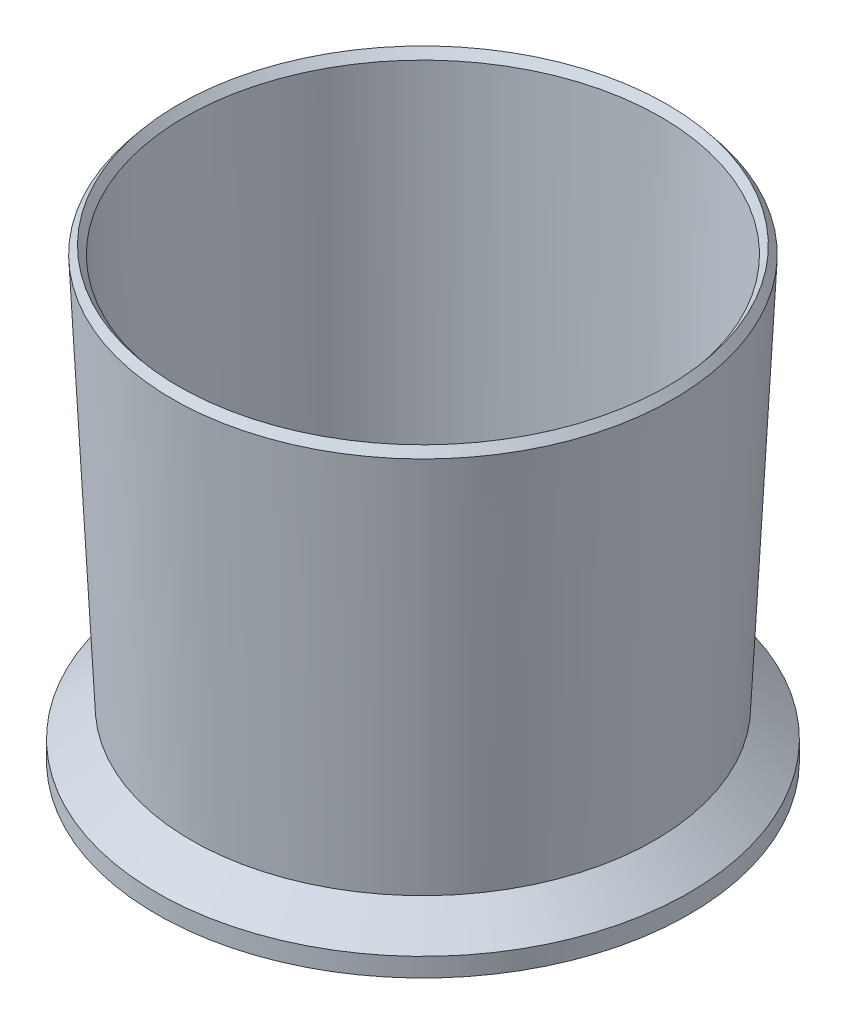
ISO-10303-21;
HEADER;
FILE_DESCRIPTION(('STEP AP214'),'2;1');
FILE_NAME('part.step','',(''),(''),'','','');
FILE_SCHEMA(('AUTOMOTIVE_DESIGN { 1 0 10303 214 1 1 1 1 }'));
ENDSEC;
DATA;
#1=APPLICATION_CONTEXT('core data for automotive mechanical design processes');
#2=APPLICATION_PROTOCOL_DEFINITION('international standard','automotive_design',2000,#1);
#3=PRODUCT_CONTEXT('',#1,'mechanical');
#4=PRODUCT('Part','Part','',(#3));
#5=PRODUCT_RELATED_PRODUCT_CATEGORY('part','',(#4));
#6=PRODUCT_DEFINITION_FORMATION('','',#4);
#7=PRODUCT_DEFINITION_CONTEXT('part definition',#1,'design');
#8=PRODUCT_DEFINITION('design','',#6,#7);
#9=PRODUCT_DEFINITION_SHAPE('','',#8);
#10=(LENGTH_UNIT() NAMED_UNIT(*) SI_UNIT(.MILLI.,.METRE.));
#11=(NAMED_UNIT(*) PLANE_ANGLE_UNIT() SI_UNIT($,.RADIAN.));
#12=(NAMED_UNIT(*) SI_UNIT($,.STERADIAN.) SOLID_ANGLE_UNIT());
#13=UNCERTAINTY_MEASURE_WITH_UNIT(LENGTH_MEASURE(1.E-05),#10,'distance_accuracy_value','');
#14=(GEOMETRIC_REPRESENTATION_CONTEXT(3) GLOBAL_UNCERTAINTY_ASSIGNED_CONTEXT((#13)) GLOBAL_UNIT_ASSIGNED_CONTEXT((#10,
#11,#12)) REPRESENTATION_CONTEXT('',''));
#15=CARTESIAN_POINT('',(0.,0.,0.));
#16=DIRECTION('',(0.,0.,1.));
#17=DIRECTION('',(1.,0.,0.));
#18=AXIS2_PLACEMENT_3D('',#15,#16,#17);
#19=CARTESIAN_POINT('',(0.,0.,0.));
#20=DIRECTION('',(0.,-1.,0.));
#21=DIRECTION('',(0.,0.,-1.));
#22=AXIS2_PLACEMENT_3D('',#19,#20,#21);
#23=PLANE('',#22);
#24=CARTESIAN_POINT('',(118.,0.,0.));
#25=DIRECTION('',(0.,1.,0.));
#26=DIRECTION('',(0.,0.,1.));
#27=AXIS2_PLACEMENT_3D('',#24,#25,#26);
#28=CIRCLE('',#27,6.50000000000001);
#29=CARTESIAN_POINT('',(118.,0.,6.50000000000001));
#30=VERTEX_POINT('',#29);
#31=EDGE_CURVE('E60',#30,#30,#28,.T.);
#32=ORIENTED_EDGE('',*,*,#31,.T.);
#33=EDGE_LOOP('',(#32));
#34=FACE_BOUND('',#33,.T.);
#35=CARTESIAN_POINT('',(59.,0.,102.190997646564));
#36=DIRECTION('',(0.,1.,0.));
#37=DIRECTION('',(0.,0.,1.));
#38=AXIS2_PLACEMENT_3D('',#35,#36,#37);
#39=CIRCLE('',#38,6.50000000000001);
#40=CARTESIAN_POINT('',(59.,0.,108.690997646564));
#41=VERTEX_POINT('',#40);
#42=EDGE_CURVE('E148',#41,#41,#39,.T.);
#43=ORIENTED_EDGE('',*,*,#42,.T.);
#44=EDGE_LOOP('',(#43));
#45=FACE_BOUND('',#44,.T.);
#46=CARTESIAN_POINT('',(-59.,0.,102.190997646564));
#47=DIRECTION('',(0.,1.,0.));
#48=DIRECTION('',(0.,0.,1.));
#49=AXIS2_PLACEMENT_3D('',#46,#47,#48);
#50=CIRCLE('',#49,6.5);
#51=CARTESIAN_POINT('',(-59.,0.,108.690997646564));
#52=VERTEX_POINT('',#51);
#53=EDGE_CURVE('E85',#52,#52,#50,.T.);
#54=ORIENTED_EDGE('',*,*,#53,.T.);
#55=EDGE_LOOP('',(#54));
#56=FACE_BOUND('',#55,.T.);
#57=CARTESIAN_POINT('',(-118.,0.,0.));
#58=DIRECTION('',(0.,1.,0.));
#59=DIRECTION('',(0.,0.,1.));
#60=AXIS2_PLACEMENT_3D('',#57,#58,#59);
#61=CIRCLE('',#60,6.50000000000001);
#62=CARTESIAN_POINT('',(-118.,0.,6.49999999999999));
#63=VERTEX_POINT('',#62);
#64=EDGE_CURVE('E160',#63,#63,#61,.T.);
#65=ORIENTED_EDGE('',*,*,#64,.T.);
#66=EDGE_LOOP('',(#65));
#67=FACE_BOUND('',#66,.T.);
#68=CARTESIAN_POINT('',(-59.,0.,-102.190997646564));
#69=DIRECTION('',(0.,1.,0.));
#70=DIRECTION('',(0.,0.,1.));
#71=AXIS2_PLACEMENT_3D('',#68,#69,#70);
#72=CIRCLE('',#71,6.5);
#73=CARTESIAN_POINT('',(-59.,0.,-95.6909976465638));
#74=VERTEX_POINT('',#73);
#75=EDGE_CURVE('E162',#74,#74,#72,.T.);
#76=ORIENTED_EDGE('',*,*,#75,.T.);
#77=EDGE_LOOP('',(#76));
#78=FACE_BOUND('',#77,.T.);
#79=CARTESIAN_POINT('',(59.,0.,-102.190997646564));
#80=DIRECTION('',(0.,1.,0.));
#81=DIRECTION('',(0.,0.,1.));
#82=AXIS2_PLACEMENT_3D('',#79,#80,#81);
#83=CIRCLE('',#82,6.50000000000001);
#84=CARTESIAN_POINT('',(59.,0.,-95.6909976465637));
#85=VERTEX_POINT('',#84);
#86=EDGE_CURVE('E164',#85,#85,#83,.T.);
#87=ORIENTED_EDGE('',*,*,#86,.T.);
#88=EDGE_LOOP('',(#87));
#89=FACE_BOUND('',#88,.T.);
#90=CARTESIAN_POINT('',(0.,0.,0.));
#91=DIRECTION('',(0.,-1.,0.));
#92=DIRECTION('',(0.,0.,-1.));
#93=AXIS2_PLACEMENT_3D('',#90,#91,#92);
#94=CIRCLE('',#93,130.);
#95=CARTESIAN_POINT('',(0.,0.,-130.));
#96=VERTEX_POINT('',#95);
#97=EDGE_CURVE('E10',#96,#96,#94,.T.);
#98=ORIENTED_EDGE('',*,*,#97,.T.);
#99=EDGE_LOOP('',(#98));
#100=FACE_BOUND('',#99,.T.);
#101=ADVANCED_FACE('F40',(#34,#45,#56,#67,#78,#89,#100),#23,.T.);
#102=CARTESIAN_POINT('',(0.,-10.,0.));
#103=DIRECTION('',(0.,-1.,0.));
#104=DIRECTION('',(0.,0.,-1.));
#105=AXIS2_PLACEMENT_3D('',#102,#103,#104);
#106=CYLINDRICAL_SURFACE('',#105,130.);
#107=CARTESIAN_POINT('',(0.,10.,0.));
#108=DIRECTION('',(0.,-1.,0.));
#109=DIRECTION('',(0.,0.,-1.));
#110=AXIS2_PLACEMENT_3D('',#107,#108,#109);
#111=CIRCLE('',#110,130.);
#112=CARTESIAN_POINT('',(0.,10.,-130.));
#113=VERTEX_POINT('',#112);
#114=EDGE_CURVE('E42',#113,#113,#111,.T.);
#115=ORIENTED_EDGE('',*,*,#114,.T.);
#116=EDGE_LOOP('',(#115));
#117=FACE_BOUND('',#116,.T.);
#118=ORIENTED_EDGE('',*,*,#97,.F.);
#119=EDGE_LOOP('',(#118));
#120=FACE_BOUND('',#119,.T.);
#121=ADVANCED_FACE('F132',(#117,#120),#106,.T.);
#122=CARTESIAN_POINT('',(130.,10.,0.));
#123=DIRECTION('',(0.,-1.,0.));
#124=DIRECTION('',(0.,0.,-1.));
#125=AXIS2_PLACEMENT_3D('',#122,#123,#124);
#126=PLANE('',#125);
#127=CARTESIAN_POINT('',(0.,10.,0.));
#128=DIRECTION('',(0.,-1.,0.));
#129=DIRECTION('',(0.,0.,-1.));
#130=AXIS2_PLACEMENT_3D('',#127,#128,#129);
#131=CIRCLE('',#130,162.);
#132=CARTESIAN_POINT('',(0.,10.,-162.));
#133=VERTEX_POINT('',#132);
#134=EDGE_CURVE('E47',#133,#133,#131,.T.);
#135=ORIENTED_EDGE('',*,*,#134,.T.);
#136=EDGE_LOOP('',(#135));
#137=FACE_BOUND('',#136,.T.);
#138=ORIENTED_EDGE('',*,*,#114,.F.);
#139=EDGE_LOOP('',(#138));
#140=FACE_BOUND('',#139,.T.);
#141=ADVANCED_FACE('F119',(#137,#140),#126,.T.);
#142=CARTESIAN_POINT('',(0.,-10.,0.));
#143=DIRECTION('',(0.,-1.,0.));
#144=DIRECTION('',(0.,0.,-1.));
#145=AXIS2_PLACEMENT_3D('',#142,#143,#144);
#146=CYLINDRICAL_SURFACE('',#145,162.);
#147=CARTESIAN_POINT('',(0.,0.,0.));
#148=DIRECTION('',(0.,-1.,0.));
#149=DIRECTION('',(0.,0.,-1.));
#150=AXIS2_PLACEMENT_3D('',#147,#148,#149);
#151=CIRCLE('',#150,162.);
#152=CARTESIAN_POINT('',(0.,0.,-162.));
#153=VERTEX_POINT('',#152);
#154=EDGE_CURVE('E114',#153,#153,#151,.T.);
#155=ORIENTED_EDGE('',*,*,#154,.T.);
#156=EDGE_LOOP('',(#155));
#157=FACE_BOUND('',#156,.T.);
#158=ORIENTED_EDGE('',*,*,#134,.F.);
#159=EDGE_LOOP('',(#158));
#160=FACE_BOUND('',#159,.T.);
#161=ADVANCED_FACE('F122',(#157,#160),#146,.F.);
#162=CARTESIAN_POINT('',(162.,0.,0.));
#163=DIRECTION('',(0.,-1.,0.));
#164=DIRECTION('',(0.,0.,-1.));
#165=AXIS2_PLACEMENT_3D('',#162,#163,#164);
#166=PLANE('',#165);
#167=CARTESIAN_POINT('',(0.,0.,0.));
#168=DIRECTION('',(0.,-1.,0.));
#169=DIRECTION('',(0.,0.,-1.));
#170=AXIS2_PLACEMENT_3D('',#167,#168,#169);
#171=CIRCLE('',#170,170.);
#172=CARTESIAN_POINT('',(0.,0.,-170.));
#173=VERTEX_POINT('',#172);
#174=EDGE_CURVE('E112',#173,#173,#171,.T.);
#175=ORIENTED_EDGE('',*,*,#174,.T.);
#176=EDGE_LOOP('',(#175));
#177=FACE_BOUND('',#176,.T.);
#178=ORIENTED_EDGE('',*,*,#154,.F.);
#179=EDGE_LOOP('',(#178));
#180=FACE_BOUND('',#179,.T.);
#181=ADVANCED_FACE('F125',(#177,#180),#166,.T.);
#182=CARTESIAN_POINT('',(0.,-10.,0.));
#183=DIRECTION('',(0.,-1.,0.));
#184=DIRECTION('',(0.,0.,-1.));
#185=AXIS2_PLACEMENT_3D('',#182,#183,#184);
#186=CYLINDRICAL_SURFACE('',#185,170.);
#187=CARTESIAN_POINT('',(0.,12.,0.));
#188=DIRECTION('',(0.,-1.,0.));
#189=DIRECTION('',(0.,0.,-1.));
#190=AXIS2_PLACEMENT_3D('',#187,#188,#189);
#191=CIRCLE('',#190,170.);
#192=CARTESIAN_POINT('',(0.,12.,-170.));
#193=VERTEX_POINT('',#192);
#194=EDGE_CURVE('E108',#193,#193,#191,.T.);
#195=ORIENTED_EDGE('',*,*,#194,.T.);
#196=EDGE_LOOP('',(#195));
#197=FACE_BOUND('',#196,.T.);
#198=ORIENTED_EDGE('',*,*,#174,.F.);
#199=EDGE_LOOP('',(#198));
#200=FACE_BOUND('',#199,.T.);
#201=ADVANCED_FACE('F131',(#197,#200),#186,.T.);
#202=CARTESIAN_POINT('',(0.,12.,0.));
#203=DIRECTION('',(0.,-1.,0.));
#204=DIRECTION('',(0.,0.,-1.));
#205=AXIS2_PLACEMENT_3D('',#202,#203,#204);
#206=CONICAL_SURFACE('',#205,170.,0.885066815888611);
#207=CARTESIAN_POINT('',(0.,30.,0.));
#208=DIRECTION('',(0.,-1.,0.));
#209=DIRECTION('',(0.,0.,-1.));
#210=AXIS2_PLACEMENT_3D('',#207,#208,#209);
#211=CIRCLE('',#210,148.);
#212=CARTESIAN_POINT('',(0.,30.,-148.));
#213=VERTEX_POINT('',#212);
#214=EDGE_CURVE('E103',#213,#213,#211,.T.);
#215=ORIENTED_EDGE('',*,*,#214,.T.);
#216=EDGE_LOOP('',(#215));
#217=FACE_BOUND('',#216,.T.);
#218=ORIENTED_EDGE('',*,*,#194,.F.);
#219=EDGE_LOOP('',(#218));
#220=FACE_BOUND('',#219,.T.);
#221=ADVANCED_FACE('F228',(#217,#220),#206,.T.);
#222=CARTESIAN_POINT('',(0.,30.,0.));
#223=DIRECTION('',(0.,1.,0.));
#224=DIRECTION('',(0.,0.,1.));
#225=AXIS2_PLACEMENT_3D('',#222,#223,#224);
#226=CONICAL_SURFACE('',#225,148.,0.0479631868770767);
#227=CARTESIAN_POINT('',(0.,280.,0.));
#228=DIRECTION('',(0.,-1.,0.));
#229=DIRECTION('',(0.,0.,-1.));
#230=AXIS2_PLACEMENT_3D('',#227,#228,#229);
#231=CIRCLE('',#230,160.);
#232=CARTESIAN_POINT('',(0.,280.,-160.));
#233=VERTEX_POINT('',#232);
#234=EDGE_CURVE('E105',#233,#233,#231,.T.);
#235=ORIENTED_EDGE('',*,*,#234,.T.);
#236=EDGE_LOOP('',(#235));
#237=FACE_BOUND('',#236,.T.);
#238=ORIENTED_EDGE('',*,*,#214,.F.);
#239=EDGE_LOOP('',(#238));
#240=FACE_BOUND('',#239,.T.);
#241=ADVANCED_FACE('F222',(#237,#240),#226,.T.);
#242=CARTESIAN_POINT('',(0.,280.,0.));
#243=DIRECTION('',(0.,-1.,0.));
#244=DIRECTION('',(0.,0.,-1.));
#245=AXIS2_PLACEMENT_3D('',#242,#243,#244);
#246=CONICAL_SURFACE('',#245,160.,0.674740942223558);
#247=CARTESIAN_POINT('',(0.,285.,0.));
#248=DIRECTION('',(0.,-1.,0.));
#249=DIRECTION('',(0.,0.,-1.));
#250=AXIS2_PLACEMENT_3D('',#247,#248,#249);
#251=CIRCLE('',#250,156.);
#252=CARTESIAN_POINT('',(0.,285.,-156.));
#253=VERTEX_POINT('',#252);
#254=EDGE_CURVE('E98',#253,#253,#251,.T.);
#255=ORIENTED_EDGE('',*,*,#254,.T.);
#256=EDGE_LOOP('',(#255));
#257=FACE_BOUND('',#256,.T.);
#258=ORIENTED_EDGE('',*,*,#234,.F.);
#259=EDGE_LOOP('',(#258));
#260=FACE_BOUND('',#259,.T.);
#261=ADVANCED_FACE('F217',(#257,#260),#246,.T.);
#262=CARTESIAN_POINT('',(0.,285.,0.));
#263=DIRECTION('',(0.,1.,0.));
#264=DIRECTION('',(0.,0.,1.));
#265=AXIS2_PLACEMENT_3D('',#262,#263,#264);
#266=CONICAL_SURFACE('',#265,156.,0.674740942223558);
#267=CARTESIAN_POINT('',(0.,280.,0.));
#268=DIRECTION('',(0.,-1.,0.));
#269=DIRECTION('',(0.,0.,-1.));
#270=AXIS2_PLACEMENT_3D('',#267,#268,#269);
#271=CIRCLE('',#270,152.);
#272=CARTESIAN_POINT('',(0.,280.,-152.));
#273=VERTEX_POINT('',#272);
#274=EDGE_CURVE('E96',#273,#273,#271,.T.);
#275=ORIENTED_EDGE('',*,*,#274,.T.);
#276=EDGE_LOOP('',(#275));
#277=FACE_BOUND('',#276,.T.);
#278=ORIENTED_EDGE('',*,*,#254,.F.);
#279=EDGE_LOOP('',(#278));
#280=FACE_BOUND('',#279,.T.);
#281=ADVANCED_FACE('F218',(#277,#280),#266,.F.);
#282=CARTESIAN_POINT('',(0.,280.,0.));
#283=DIRECTION('',(0.,1.,0.));
#284=DIRECTION('',(0.,0.,1.));
#285=AXIS2_PLACEMENT_3D('',#282,#283,#284);
#286=CONICAL_SURFACE('',#285,152.,0.0343376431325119);
#287=CARTESIAN_POINT('',(0.,18.,0.));
#288=DIRECTION('',(0.,-1.,0.));
#289=DIRECTION('',(0.,0.,-1.));
#290=AXIS2_PLACEMENT_3D('',#287,#288,#289);
#291=CIRCLE('',#290,143.);
#292=CARTESIAN_POINT('',(0.,18.,-143.));
#293=VERTEX_POINT('',#292);
#294=EDGE_CURVE('E93',#293,#293,#291,.T.);
#295=ORIENTED_EDGE('',*,*,#294,.T.);
#296=EDGE_LOOP('',(#295));
#297=FACE_BOUND('',#296,.T.);
#298=ORIENTED_EDGE('',*,*,#274,.F.);
#299=EDGE_LOOP('',(#298));
#300=FACE_BOUND('',#299,.T.);
#301=ADVANCED_FACE('F211',(#297,#300),#286,.F.);
#302=CARTESIAN_POINT('',(143.,18.,0.));
#303=DIRECTION('',(0.,1.,0.));
#304=DIRECTION('',(0.,0.,1.));
#305=AXIS2_PLACEMENT_3D('',#302,#303,#304);
#306=PLANE('',#305);
#307=CARTESIAN_POINT('',(118.,18.,0.));
#308=DIRECTION('',(0.,1.,0.));
#309=DIRECTION('',(0.,0.,1.));
#310=AXIS2_PLACEMENT_3D('',#307,#308,#309);
#311=CIRCLE('',#310,6.50000000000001);
#312=CARTESIAN_POINT('',(118.,18.,6.50000000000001));
#313=VERTEX_POINT('',#312);
#314=EDGE_CURVE('E37',#313,#313,#311,.F.);
#315=ORIENTED_EDGE('',*,*,#314,.T.);
#316=EDGE_LOOP('',(#315));
#317=FACE_BOUND('',#316,.T.);
#318=CARTESIAN_POINT('',(59.,18.,102.190997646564));
#319=DIRECTION('',(0.,1.,0.));
#320=DIRECTION('',(0.,0.,1.));
#321=AXIS2_PLACEMENT_3D('',#318,#319,#320);
#322=CIRCLE('',#321,6.50000000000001);
#323=CARTESIAN_POINT('',(59.,18.,108.690997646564));
#324=VERTEX_POINT('',#323);
#325=EDGE_CURVE('E61',#324,#324,#322,.F.);
#326=ORIENTED_EDGE('',*,*,#325,.T.);
#327=EDGE_LOOP('',(#326));
#328=FACE_BOUND('',#327,.T.);
#329=CARTESIAN_POINT('',(-59.,18.,102.190997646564));
#330=DIRECTION('',(0.,1.,0.));
#331=DIRECTION('',(0.,0.,1.));
#332=AXIS2_PLACEMENT_3D('',#329,#330,#331);
#333=CIRCLE('',#332,6.5);
#334=CARTESIAN_POINT('',(-59.,18.,108.690997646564));
#335=VERTEX_POINT('',#334);
#336=EDGE_CURVE('E63',#335,#335,#333,.F.);
#337=ORIENTED_EDGE('',*,*,#336,.T.);
#338=EDGE_LOOP('',(#337));
#339=FACE_BOUND('',#338,.T.);
#340=CARTESIAN_POINT('',(-118.,18.,0.));
#341=DIRECTION('',(0.,1.,0.));
#342=DIRECTION('',(0.,0.,1.));
#343=AXIS2_PLACEMENT_3D('',#340,#341,#342);
#344=CIRCLE('',#343,6.50000000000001);
#345=CARTESIAN_POINT('',(-118.,18.,6.49999999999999));
#346=VERTEX_POINT('',#345);
#347=EDGE_CURVE('E58',#346,#346,#344,.F.);
#348=ORIENTED_EDGE('',*,*,#347,.T.);
#349=EDGE_LOOP('',(#348));
#350=FACE_BOUND('',#349,.T.);
#351=CARTESIAN_POINT('',(-59.,18.,-102.190997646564));
#352=DIRECTION('',(0.,1.,0.));
#353=DIRECTION('',(0.,0.,1.));
#354=AXIS2_PLACEMENT_3D('',#351,#352,#353);
#355=CIRCLE('',#354,6.5);
#356=CARTESIAN_POINT('',(-59.,18.,-95.6909976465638));
#357=VERTEX_POINT('',#356);
#358=EDGE_CURVE('E57',#357,#357,#355,.F.);
#359=ORIENTED_EDGE('',*,*,#358,.T.);
#360=EDGE_LOOP('',(#359));
#361=FACE_BOUND('',#360,.T.);
#362=CARTESIAN_POINT('',(59.,18.,-102.190997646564));
#363=DIRECTION('',(0.,1.,0.));
#364=DIRECTION('',(0.,0.,1.));
#365=AXIS2_PLACEMENT_3D('',#362,#363,#364);
#366=CIRCLE('',#365,6.50000000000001);
#367=CARTESIAN_POINT('',(59.,18.,-95.6909976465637));
#368=VERTEX_POINT('',#367);
#369=EDGE_CURVE('E52',#368,#368,#366,.F.);
#370=ORIENTED_EDGE('',*,*,#369,.T.);
#371=EDGE_LOOP('',(#370));
#372=FACE_BOUND('',#371,.T.);
#373=CARTESIAN_POINT('',(0.,18.,0.));
#374=DIRECTION('',(0.,-1.,0.));
#375=DIRECTION('',(0.,0.,-1.));
#376=AXIS2_PLACEMENT_3D('',#373,#374,#375);
#377=CIRCLE('',#376,100.);
#378=CARTESIAN_POINT('',(0.,18.,-100.));
#379=VERTEX_POINT('',#378);
#380=EDGE_CURVE('E89',#379,#379,#377,.T.);
#381=ORIENTED_EDGE('',*,*,#380,.T.);
#382=EDGE_LOOP('',(#381));
#383=FACE_BOUND('',#382,.T.);
#384=ORIENTED_EDGE('',*,*,#294,.F.);
#385=EDGE_LOOP('',(#384));
#386=FACE_BOUND('',#385,.T.);
#387=ADVANCED_FACE('F206',(#317,#328,#339,#350,#361,#372,#383,#386),#306,.T.);
#388=CARTESIAN_POINT('',(0.,18.,0.));
#389=DIRECTION('',(0.,-1.,0.));
#390=DIRECTION('',(0.,0.,-1.));
#391=AXIS2_PLACEMENT_3D('',#388,#389,#390);
#392=CONICAL_SURFACE('',#391,100.,0.845930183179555);
#393=CARTESIAN_POINT('',(0.,80.,0.));
#394=DIRECTION('',(0.,-1.,0.));
#395=DIRECTION('',(0.,0.,-1.));
#396=AXIS2_PLACEMENT_3D('',#393,#394,#395);
#397=CIRCLE('',#396,30.);
#398=CARTESIAN_POINT('',(0.,80.,-30.));
#399=VERTEX_POINT('',#398);
#400=EDGE_CURVE('E90',#399,#399,#397,.T.);
#401=CARTESIAN_POINT('',(0.,80.,-30.));
#402=CARTESIAN_POINT('',(0.,79.3541666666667,-30.7291666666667));
#403=CARTESIAN_POINT('',(0.,78.7083333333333,-31.4583333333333));
#404=CARTESIAN_POINT('',(0.,77.4166666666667,-32.9166666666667));
#405=CARTESIAN_POINT('',(0.,76.7708333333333,-33.6458333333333));
#406=CARTESIAN_POINT('',(0.,75.4791666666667,-35.1041666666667));
#407=CARTESIAN_POINT('',(0.,74.8333333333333,-35.8333333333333));
#408=CARTESIAN_POINT('',(0.,73.5416666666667,-37.2916666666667));
#409=CARTESIAN_POINT('',(0.,72.8958333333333,-38.0208333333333));
#410=CARTESIAN_POINT('',(0.,71.6041666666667,-39.4791666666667));
#411=CARTESIAN_POINT('',(0.,70.9583333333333,-40.2083333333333));
#412=CARTESIAN_POINT('',(0.,69.6666666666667,-41.6666666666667));
#413=CARTESIAN_POINT('',(0.,69.0208333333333,-42.3958333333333));
#414=CARTESIAN_POINT('',(0.,67.7291666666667,-43.8541666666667));
#415=CARTESIAN_POINT('',(0.,67.0833333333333,-44.5833333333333));
#416=CARTESIAN_POINT('',(0.,65.7916666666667,-46.0416666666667));
#417=CARTESIAN_POINT('',(0.,65.1458333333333,-46.7708333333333));
#418=CARTESIAN_POINT('',(0.,63.8541666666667,-48.2291666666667));
#419=CARTESIAN_POINT('',(0.,63.2083333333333,-48.9583333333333));
#420=CARTESIAN_POINT('',(0.,61.9166666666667,-50.4166666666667));
#421=CARTESIAN_POINT('',(0.,61.2708333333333,-51.1458333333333));
#422=CARTESIAN_POINT('',(0.,59.9791666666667,-52.6041666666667));
#423=CARTESIAN_POINT('',(0.,59.3333333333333,-53.3333333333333));
#424=CARTESIAN_POINT('',(0.,58.0416666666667,-54.7916666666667));
#425=CARTESIAN_POINT('',(0.,57.3958333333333,-55.5208333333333));
#426=CARTESIAN_POINT('',(0.,56.1041666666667,-56.9791666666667));
#427=CARTESIAN_POINT('',(0.,55.4583333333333,-57.7083333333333));
#428=CARTESIAN_POINT('',(0.,54.1666666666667,-59.1666666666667));
#429=CARTESIAN_POINT('',(0.,53.5208333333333,-59.8958333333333));
#430=CARTESIAN_POINT('',(0.,52.2291666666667,-61.3541666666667));
#431=CARTESIAN_POINT('',(0.,51.5833333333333,-62.0833333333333));
#432=CARTESIAN_POINT('',(0.,50.2916666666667,-63.5416666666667));
#433=CARTESIAN_POINT('',(0.,49.6458333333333,-64.2708333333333));
#434=CARTESIAN_POINT('',(0.,48.3541666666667,-65.7291666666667));
#435=CARTESIAN_POINT('',(0.,47.7083333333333,-66.4583333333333));
#436=CARTESIAN_POINT('',(0.,46.4166666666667,-67.9166666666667));
#437=CARTESIAN_POINT('',(0.,45.7708333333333,-68.6458333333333));
#438=CARTESIAN_POINT('',(0.,44.4791666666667,-70.1041666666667));
#439=CARTESIAN_POINT('',(0.,43.8333333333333,-70.8333333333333));
#440=CARTESIAN_POINT('',(0.,42.5416666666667,-72.2916666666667));
#441=CARTESIAN_POINT('',(0.,41.8958333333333,-73.0208333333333));
#442=CARTESIAN_POINT('',(0.,40.6041666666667,-74.4791666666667));
#443=CARTESIAN_POINT('',(0.,39.9583333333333,-75.2083333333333));
#444=CARTESIAN_POINT('',(0.,38.6666666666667,-76.6666666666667));
#445=CARTESIAN_POINT('',(0.,38.0208333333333,-77.3958333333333));
#446=CARTESIAN_POINT('',(0.,36.7291666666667,-78.8541666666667));
#447=CARTESIAN_POINT('',(0.,36.0833333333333,-79.5833333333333));
#448=CARTESIAN_POINT('',(0.,34.7916666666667,-81.0416666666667));
#449=CARTESIAN_POINT('',(0.,34.1458333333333,-81.7708333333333));
#450=CARTESIAN_POINT('',(0.,32.8541666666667,-83.2291666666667));
#451=CARTESIAN_POINT('',(0.,32.2083333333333,-83.9583333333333));
#452=CARTESIAN_POINT('',(0.,30.9166666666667,-85.4166666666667));
#453=CARTESIAN_POINT('',(0.,30.2708333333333,-86.1458333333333));
#454=CARTESIAN_POINT('',(0.,28.9791666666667,-87.6041666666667));
#455=CARTESIAN_POINT('',(0.,28.3333333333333,-88.3333333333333));
#456=CARTESIAN_POINT('',(0.,27.0416666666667,-89.7916666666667));
#457=CARTESIAN_POINT('',(0.,26.3958333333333,-90.5208333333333));
#458=CARTESIAN_POINT('',(0.,25.1041666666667,-91.9791666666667));
#459=CARTESIAN_POINT('',(0.,24.4583333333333,-92.7083333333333));
#460=CARTESIAN_POINT('',(0.,23.1666666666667,-94.1666666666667));
#461=CARTESIAN_POINT('',(0.,22.5208333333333,-94.8958333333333));
#462=CARTESIAN_POINT('',(0.,21.2291666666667,-96.3541666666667));
#463=CARTESIAN_POINT('',(0.,20.5833333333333,-97.0833333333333));
#464=CARTESIAN_POINT('',(0.,19.2916666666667,-98.5416666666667));
#465=CARTESIAN_POINT('',(0.,18.6458333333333,-99.2708333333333));
#466=CARTESIAN_POINT('',(0.,18.,-100.));
#467=B_SPLINE_CURVE_WITH_KNOTS('',3,(#401,#402,#403,#404,#405,#406,#407,#408,#409,#410,#411,
#412,#413,#414,#415,#416,#417,#418,#419,#420,#421,#422,#423,#424,#425,#426,#427,#428,#429,#430,
#431,#432,#433,#434,#435,#436,#437,#438,#439,#440,#441,#442,#443,#444,#445,#446,#447,#448,#449,
#450,#451,#452,#453,#454,#455,#456,#457,#458,#459,#460,#461,#462,#463,#464,#465,#466),
.UNSPECIFIED.,.F.,.F.,(4,2,2,2,2,2,2,2,2,2,2,2,2,2,2,2,2,2,2,2,2,2,2,2,2,2,2,2,2,2,2,2,4),(0.,
2.92216743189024,5.8443348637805,8.76650229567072,11.688669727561,14.6108371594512,
17.5330045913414,20.4551720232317,23.3773394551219,26.2995068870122,29.2216743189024,
32.1438417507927,35.0660091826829,37.9881766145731,40.9103440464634,43.8325114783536,
46.7546789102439,49.6768463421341,52.5990137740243,55.5211812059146,58.4433486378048,
61.3655160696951,64.2876835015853,67.2098509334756,70.1320183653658,73.054185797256,
75.9763532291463,78.8985206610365,81.8206880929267,84.742855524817,87.6650229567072,
90.5871903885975,93.5093578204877),.UNSPECIFIED.);
#468=EDGE_CURVE('BSEAM207',#399,#379,#467,.T.);
#469=ORIENTED_EDGE('',*,*,#400,.T.);
#470=ORIENTED_EDGE('',*,*,#380,.F.);
#471=ORIENTED_EDGE('',*,*,#468,.T.);
#472=ORIENTED_EDGE('',*,*,#468,.F.);
#473=EDGE_LOOP('',(#469,#471,#470,#472));
#474=FACE_BOUND('',#473,.T.);
#475=ADVANCED_FACE('F207',(#474),#392,.T.);
#476=CARTESIAN_POINT('',(0.,-10.,0.));
#477=DIRECTION('',(0.,-1.,0.));
#478=DIRECTION('',(0.,0.,-1.));
#479=AXIS2_PLACEMENT_3D('',#476,#477,#478);
#480=CYLINDRICAL_SURFACE('',#479,30.);
#481=CARTESIAN_POINT('',(0.,100.,0.));
#482=DIRECTION('',(0.,-1.,0.));
#483=DIRECTION('',(0.,0.,-1.));
#484=AXIS2_PLACEMENT_3D('',#481,#482,#483);
#485=CIRCLE('',#484,30.);
#486=CARTESIAN_POINT('',(0.,100.,-30.));
#487=VERTEX_POINT('',#486);
#488=EDGE_CURVE('E80',#487,#487,#485,.T.);
#489=ORIENTED_EDGE('',*,*,#488,.T.);
#490=EDGE_LOOP('',(#489));
#491=FACE_BOUND('',#490,.T.);
#492=ORIENTED_EDGE('',*,*,#400,.F.);
#493=EDGE_LOOP('',(#492));
#494=FACE_BOUND('',#493,.T.);
#495=ADVANCED_FACE('F205',(#491,#494),#480,.T.);
#496=CARTESIAN_POINT('',(30.,100.,0.));
#497=DIRECTION('',(0.,1.,0.));
#498=DIRECTION('',(0.,0.,1.));
#499=AXIS2_PLACEMENT_3D('',#496,#497,#498);
#500=PLANE('',#499);
#501=CARTESIAN_POINT('',(0.,100.,0.));
#502=DIRECTION('',(0.,-1.,0.));
#503=DIRECTION('',(0.,0.,-1.));
#504=AXIS2_PLACEMENT_3D('',#501,#502,#503);
#505=CIRCLE('',#504,13.5);
#506=CARTESIAN_POINT('',(0.,100.,-13.5));
#507=VERTEX_POINT('',#506);
#508=EDGE_CURVE('E74',#507,#507,#505,.T.);
#509=ORIENTED_EDGE('',*,*,#508,.T.);
#510=EDGE_LOOP('',(#509));
#511=FACE_BOUND('',#510,.T.);
#512=ORIENTED_EDGE('',*,*,#488,.F.);
#513=EDGE_LOOP('',(#512));
#514=FACE_BOUND('',#513,.T.);
#515=ADVANCED_FACE('F199',(#511,#514),#500,.T.);
#516=CARTESIAN_POINT('',(0.,-10.,0.));
#517=DIRECTION('',(0.,-1.,0.));
#518=DIRECTION('',(0.,0.,-1.));
#519=AXIS2_PLACEMENT_3D('',#516,#517,#518);
#520=CYLINDRICAL_SURFACE('',#519,13.5);
#521=CARTESIAN_POINT('',(0.,8.,0.));
#522=DIRECTION('',(0.,-1.,0.));
#523=DIRECTION('',(0.,0.,-1.));
#524=AXIS2_PLACEMENT_3D('',#521,#522,#523);
#525=CIRCLE('',#524,13.5);
#526=CARTESIAN_POINT('',(0.,8.,-13.5));
#527=VERTEX_POINT('',#526);
#528=EDGE_CURVE('E68',#527,#527,#525,.T.);
#529=ORIENTED_EDGE('',*,*,#528,.T.);
#530=EDGE_LOOP('',(#529));
#531=FACE_BOUND('',#530,.T.);
#532=ORIENTED_EDGE('',*,*,#508,.F.);
#533=EDGE_LOOP('',(#532));
#534=FACE_BOUND('',#533,.T.);
#535=ADVANCED_FACE('F185',(#531,#534),#520,.F.);
#536=CARTESIAN_POINT('',(13.5,8.,0.));
#537=DIRECTION('',(0.,1.,0.));
#538=DIRECTION('',(0.,0.,1.));
#539=AXIS2_PLACEMENT_3D('',#536,#537,#538);
#540=PLANE('',#539);
#541=ORIENTED_EDGE('',*,*,#528,.F.);
#542=EDGE_LOOP('',(#541));
#543=FACE_BOUND('',#542,.T.);
#544=ADVANCED_FACE('F171',(#543),#540,.T.);
#545=CARTESIAN_POINT('',(59.,285.,-102.190997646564));
#546=DIRECTION('',(0.,-1.,0.));
#547=DIRECTION('',(0.,0.,-1.));
#548=AXIS2_PLACEMENT_3D('',#545,#546,#547);
#549=CYLINDRICAL_SURFACE('',#548,6.50000000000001);
#550=ORIENTED_EDGE('',*,*,#369,.F.);
#551=EDGE_LOOP('',(#550));
#552=FACE_BOUND('',#551,.T.);
#553=ORIENTED_EDGE('',*,*,#86,.F.);
#554=EDGE_LOOP('',(#553));
#555=FACE_BOUND('',#554,.T.);
#556=ADVANCED_FACE('F169',(#552,#555),#549,.F.);
#557=CARTESIAN_POINT('',(-59.,285.,-102.190997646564));
#558=DIRECTION('',(0.,-1.,0.));
#559=DIRECTION('',(0.,0.,-1.));
#560=AXIS2_PLACEMENT_3D('',#557,#558,#559);
#561=CYLINDRICAL_SURFACE('',#560,6.5);
#562=ORIENTED_EDGE('',*,*,#358,.F.);
#563=EDGE_LOOP('',(#562));
#564=FACE_BOUND('',#563,.T.);
#565=ORIENTED_EDGE('',*,*,#75,.F.);
#566=EDGE_LOOP('',(#565));
#567=FACE_BOUND('',#566,.T.);
#568=ADVANCED_FACE('F175',(#564,#567),#561,.F.);
#569=CARTESIAN_POINT('',(-118.,285.,0.));
#570=DIRECTION('',(0.,-1.,0.));
#571=DIRECTION('',(0.,0.,-1.));
#572=AXIS2_PLACEMENT_3D('',#569,#570,#571);
#573=CYLINDRICAL_SURFACE('',#572,6.50000000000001);
#574=ORIENTED_EDGE('',*,*,#347,.F.);
#575=EDGE_LOOP('',(#574));
#576=FACE_BOUND('',#575,.T.);
#577=ORIENTED_EDGE('',*,*,#64,.F.);
#578=EDGE_LOOP('',(#577));
#579=FACE_BOUND('',#578,.T.);
#580=ADVANCED_FACE('F177',(#576,#579),#573,.F.);
#581=CARTESIAN_POINT('',(-59.,285.,102.190997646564));
#582=DIRECTION('',(0.,-1.,0.));
#583=DIRECTION('',(0.,0.,-1.));
#584=AXIS2_PLACEMENT_3D('',#581,#582,#583);
#585=CYLINDRICAL_SURFACE('',#584,6.5);
#586=ORIENTED_EDGE('',*,*,#336,.F.);
#587=EDGE_LOOP('',(#586));
#588=FACE_BOUND('',#587,.T.);
#589=ORIENTED_EDGE('',*,*,#53,.F.);
#590=EDGE_LOOP('',(#589));
#591=FACE_BOUND('',#590,.T.);
#592=ADVANCED_FACE('F195',(#588,#591),#585,.F.);
#593=CARTESIAN_POINT('',(59.,285.,102.190997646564));
#594=DIRECTION('',(0.,-1.,0.));
#595=DIRECTION('',(0.,0.,-1.));
#596=AXIS2_PLACEMENT_3D('',#593,#594,#595);
#597=CYLINDRICAL_SURFACE('',#596,6.50000000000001);
#598=ORIENTED_EDGE('',*,*,#325,.F.);
#599=EDGE_LOOP('',(#598));
#600=FACE_BOUND('',#599,.T.);
#601=ORIENTED_EDGE('',*,*,#42,.F.);
#602=EDGE_LOOP('',(#601));
#603=FACE_BOUND('',#602,.T.);
#604=ADVANCED_FACE('F190',(#600,#603),#597,.F.);
#605=CARTESIAN_POINT('',(118.,285.,0.));
#606=DIRECTION('',(0.,-1.,0.));
#607=DIRECTION('',(0.,0.,-1.));
#608=AXIS2_PLACEMENT_3D('',#605,#606,#607);
#609=CYLINDRICAL_SURFACE('',#608,6.50000000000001);
#610=ORIENTED_EDGE('',*,*,#314,.F.);
#611=EDGE_LOOP('',(#610));
#612=FACE_BOUND('',#611,.T.);
#613=ORIENTED_EDGE('',*,*,#31,.F.);
#614=EDGE_LOOP('',(#613));
#615=FACE_BOUND('',#614,.T.);
#616=ADVANCED_FACE('F329',(#612,#615),#609,.F.);
#617=CLOSED_SHELL('',(#101,#121,#141,#161,#181,#201,#221,#241,#261,#281,#301,#387,#475,#495,
#515,#535,#544,#556,#568,#580,#592,#604,#616));
#618=MANIFOLD_SOLID_BREP('B2',#617);
#619=ADVANCED_BREP_SHAPE_REPRESENTATION('',(#18,#618),#14);
#620=SHAPE_DEFINITION_REPRESENTATION(#9,#619);
ENDSEC;
END-ISO-10303-21;
